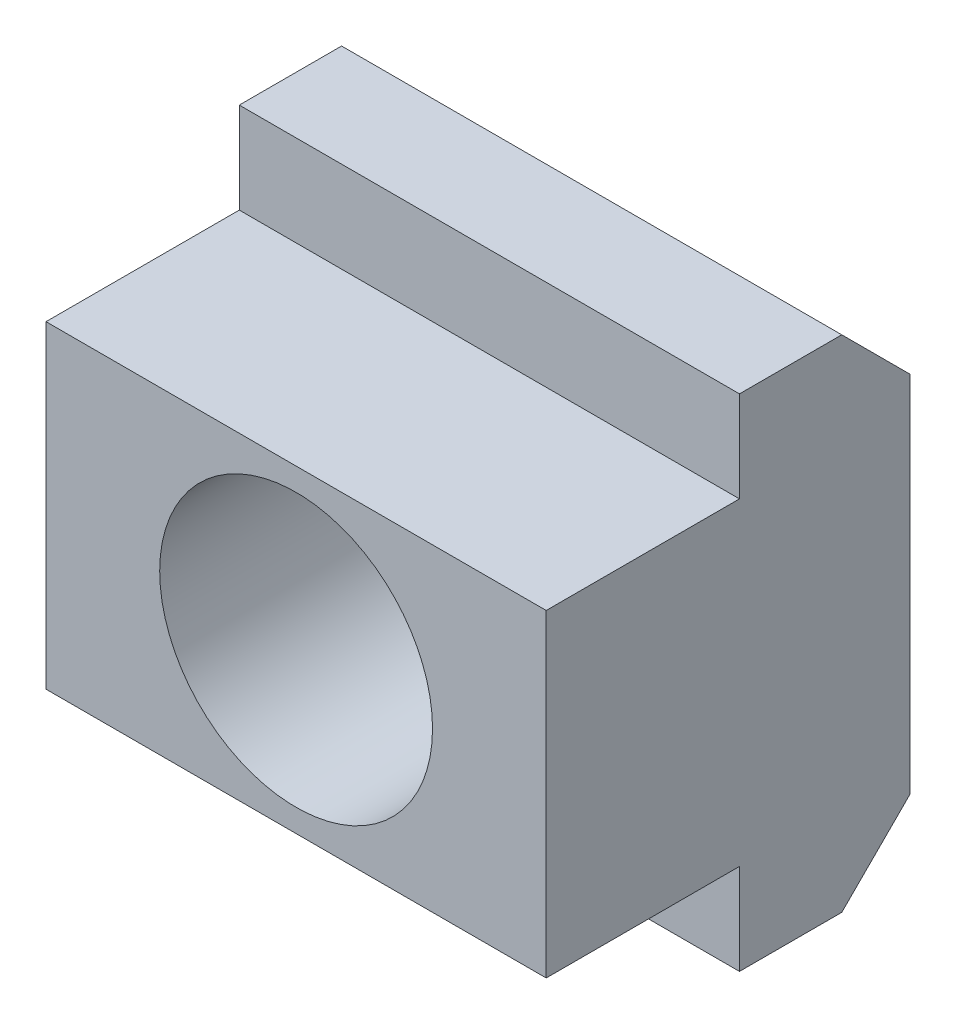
ISO-10303-21;
HEADER;
FILE_DESCRIPTION(('STEP AP214'),'2;1');
FILE_NAME('part.step','',(''),(''),'','','');
FILE_SCHEMA(('AUTOMOTIVE_DESIGN { 1 0 10303 214 1 1 1 1 }'));
ENDSEC;
DATA;
#1=APPLICATION_CONTEXT('core data for automotive mechanical design processes');
#2=APPLICATION_PROTOCOL_DEFINITION('international standard','automotive_design',2000,#1);
#3=PRODUCT_CONTEXT('',#1,'mechanical');
#4=PRODUCT('Part','Part','',(#3));
#5=PRODUCT_RELATED_PRODUCT_CATEGORY('part','',(#4));
#6=PRODUCT_DEFINITION_FORMATION('','',#4);
#7=PRODUCT_DEFINITION_CONTEXT('part definition',#1,'design');
#8=PRODUCT_DEFINITION('design','',#6,#7);
#9=PRODUCT_DEFINITION_SHAPE('','',#8);
#10=(LENGTH_UNIT() NAMED_UNIT(*) SI_UNIT(.MILLI.,.METRE.));
#11=(NAMED_UNIT(*) PLANE_ANGLE_UNIT() SI_UNIT($,.RADIAN.));
#12=(NAMED_UNIT(*) SI_UNIT($,.STERADIAN.) SOLID_ANGLE_UNIT());
#13=UNCERTAINTY_MEASURE_WITH_UNIT(LENGTH_MEASURE(1.E-05),#10,'distance_accuracy_value','');
#14=(GEOMETRIC_REPRESENTATION_CONTEXT(3) GLOBAL_UNCERTAINTY_ASSIGNED_CONTEXT((#13)) GLOBAL_UNIT_ASSIGNED_CONTEXT((#10,
#11,#12)) REPRESENTATION_CONTEXT('',''));
#15=CARTESIAN_POINT('',(0.,0.,0.));
#16=DIRECTION('',(0.,0.,1.));
#17=DIRECTION('',(1.,0.,0.));
#18=AXIS2_PLACEMENT_3D('',#15,#16,#17);
#19=CARTESIAN_POINT('',(-11.,-7.,8.5));
#20=DIRECTION('',(0.,1.,0.));
#21=DIRECTION('',(-1.,0.,0.));
#22=AXIS2_PLACEMENT_3D('',#19,#20,#21);
#23=PLANE('',#22);
#24=DIRECTION('',(0.,0.,1.));
#25=VECTOR('',#24,1.);
#26=CARTESIAN_POINT('',(11.,-7.,8.5));
#27=LINE('',#26,#25);
#28=CARTESIAN_POINT('',(11.,-7.,0.));
#29=VERTEX_POINT('',#28);
#30=CARTESIAN_POINT('',(11.,-7.,8.5));
#31=VERTEX_POINT('',#30);
#32=EDGE_CURVE('E99',#29,#31,#27,.T.);
#33=ORIENTED_EDGE('',*,*,#32,.T.);
#34=DIRECTION('',(1.,0.,0.));
#35=VECTOR('',#34,1.);
#36=CARTESIAN_POINT('',(-11.,-7.,8.5));
#37=LINE('',#36,#35);
#38=CARTESIAN_POINT('',(-11.,-7.,8.5));
#39=VERTEX_POINT('',#38);
#40=EDGE_CURVE('E107',#39,#31,#37,.T.);
#41=ORIENTED_EDGE('',*,*,#40,.F.);
#42=DIRECTION('',(0.,0.,1.));
#43=VECTOR('',#42,1.);
#44=CARTESIAN_POINT('',(-11.,-7.,8.5));
#45=LINE('',#44,#43);
#46=CARTESIAN_POINT('',(-11.,-7.,0.));
#47=VERTEX_POINT('',#46);
#48=EDGE_CURVE('E137',#47,#39,#45,.T.);
#49=ORIENTED_EDGE('',*,*,#48,.F.);
#50=DIRECTION('',(1.,0.,0.));
#51=VECTOR('',#50,1.);
#52=CARTESIAN_POINT('',(-11.,-7.,0.));
#53=LINE('',#52,#51);
#54=EDGE_CURVE('E118',#47,#29,#53,.T.);
#55=ORIENTED_EDGE('',*,*,#54,.T.);
#56=EDGE_LOOP('',(#33,#41,#49,#55));
#57=FACE_BOUND('',#56,.T.);
#58=ADVANCED_FACE('F15',(#57),#23,.F.);
#59=CARTESIAN_POINT('',(-11.,7.,8.5));
#60=DIRECTION('',(0.,0.,-1.));
#61=DIRECTION('',(1.,0.,0.));
#62=AXIS2_PLACEMENT_3D('',#59,#60,#61);
#63=PLANE('',#62);
#64=CARTESIAN_POINT('',(0.,0.,8.5));
#65=DIRECTION('',(0.,0.,1.));
#66=DIRECTION('',(-1.,0.,0.));
#67=AXIS2_PLACEMENT_3D('',#64,#65,#66);
#68=CIRCLE('',#67,6.);
#69=CARTESIAN_POINT('',(-6.,0.,8.5));
#70=VERTEX_POINT('',#69);
#71=EDGE_CURVE('E122',#70,#70,#68,.T.);
#72=ORIENTED_EDGE('',*,*,#71,.F.);
#73=EDGE_LOOP('',(#72));
#74=FACE_BOUND('',#73,.T.);
#75=DIRECTION('',(0.,1.,0.));
#76=VECTOR('',#75,1.);
#77=CARTESIAN_POINT('',(11.,7.,8.5));
#78=LINE('',#77,#76);
#79=CARTESIAN_POINT('',(11.,7.,8.5));
#80=VERTEX_POINT('',#79);
#81=EDGE_CURVE('E93',#31,#80,#78,.T.);
#82=ORIENTED_EDGE('',*,*,#81,.T.);
#83=DIRECTION('',(1.,0.,0.));
#84=VECTOR('',#83,1.);
#85=CARTESIAN_POINT('',(-11.,7.,8.5));
#86=LINE('',#85,#84);
#87=CARTESIAN_POINT('',(-11.,7.,8.5));
#88=VERTEX_POINT('',#87);
#89=EDGE_CURVE('E114',#88,#80,#86,.T.);
#90=ORIENTED_EDGE('',*,*,#89,.F.);
#91=DIRECTION('',(0.,1.,0.));
#92=VECTOR('',#91,1.);
#93=CARTESIAN_POINT('',(-11.,7.,8.5));
#94=LINE('',#93,#92);
#95=EDGE_CURVE('E109',#39,#88,#94,.T.);
#96=ORIENTED_EDGE('',*,*,#95,.F.);
#97=ORIENTED_EDGE('',*,*,#40,.T.);
#98=EDGE_LOOP('',(#82,#90,#96,#97));
#99=FACE_BOUND('',#98,.T.);
#100=ADVANCED_FACE('F108',(#74,#99),#63,.F.);
#101=CARTESIAN_POINT('',(-11.,7.,8.5));
#102=DIRECTION('',(0.,-1.,0.));
#103=DIRECTION('',(1.,0.,0.));
#104=AXIS2_PLACEMENT_3D('',#101,#102,#103);
#105=PLANE('',#104);
#106=DIRECTION('',(0.,0.,-1.));
#107=VECTOR('',#106,1.);
#108=CARTESIAN_POINT('',(11.,7.,8.5));
#109=LINE('',#108,#107);
#110=CARTESIAN_POINT('',(11.,7.,0.));
#111=VERTEX_POINT('',#110);
#112=EDGE_CURVE('E101',#80,#111,#109,.T.);
#113=ORIENTED_EDGE('',*,*,#112,.T.);
#114=DIRECTION('',(1.,0.,0.));
#115=VECTOR('',#114,1.);
#116=CARTESIAN_POINT('',(-11.,7.,0.));
#117=LINE('',#116,#115);
#118=CARTESIAN_POINT('',(-11.,7.,0.));
#119=VERTEX_POINT('',#118);
#120=EDGE_CURVE('E159',#119,#111,#117,.T.);
#121=ORIENTED_EDGE('',*,*,#120,.F.);
#122=DIRECTION('',(0.,0.,-1.));
#123=VECTOR('',#122,1.);
#124=CARTESIAN_POINT('',(-11.,7.,8.5));
#125=LINE('',#124,#123);
#126=EDGE_CURVE('E140',#88,#119,#125,.T.);
#127=ORIENTED_EDGE('',*,*,#126,.F.);
#128=ORIENTED_EDGE('',*,*,#89,.T.);
#129=EDGE_LOOP('',(#113,#121,#127,#128));
#130=FACE_BOUND('',#129,.T.);
#131=ADVANCED_FACE('F200',(#130),#105,.F.);
#132=CARTESIAN_POINT('',(-11.,7.,0.));
#133=DIRECTION('',(0.,0.,-1.));
#134=DIRECTION('',(0.,-1.,0.));
#135=AXIS2_PLACEMENT_3D('',#132,#133,#134);
#136=PLANE('',#135);
#137=DIRECTION('',(0.,1.,0.));
#138=VECTOR('',#137,1.);
#139=CARTESIAN_POINT('',(11.,7.,0.));
#140=LINE('',#139,#138);
#141=CARTESIAN_POINT('',(11.,11.,0.));
#142=VERTEX_POINT('',#141);
#143=EDGE_CURVE('E127',#111,#142,#140,.T.);
#144=ORIENTED_EDGE('',*,*,#143,.T.);
#145=DIRECTION('',(1.,0.,0.));
#146=VECTOR('',#145,1.);
#147=CARTESIAN_POINT('',(-11.,11.,0.));
#148=LINE('',#147,#146);
#149=CARTESIAN_POINT('',(-11.,11.,0.));
#150=VERTEX_POINT('',#149);
#151=EDGE_CURVE('E156',#150,#142,#148,.T.);
#152=ORIENTED_EDGE('',*,*,#151,.F.);
#153=DIRECTION('',(0.,1.,0.));
#154=VECTOR('',#153,1.);
#155=CARTESIAN_POINT('',(-11.,7.,0.));
#156=LINE('',#155,#154);
#157=EDGE_CURVE('E142',#119,#150,#156,.T.);
#158=ORIENTED_EDGE('',*,*,#157,.F.);
#159=ORIENTED_EDGE('',*,*,#120,.T.);
#160=EDGE_LOOP('',(#144,#152,#158,#159));
#161=FACE_BOUND('',#160,.T.);
#162=ADVANCED_FACE('F196',(#161),#136,.F.);
#163=CARTESIAN_POINT('',(-11.,11.,0.));
#164=DIRECTION('',(0.,-1.,0.));
#165=DIRECTION('',(1.,0.,0.));
#166=AXIS2_PLACEMENT_3D('',#163,#164,#165);
#167=PLANE('',#166);
#168=DIRECTION('',(0.,0.,-1.));
#169=VECTOR('',#168,1.);
#170=CARTESIAN_POINT('',(11.,11.,0.));
#171=LINE('',#170,#169);
#172=CARTESIAN_POINT('',(11.,11.,-4.5));
#173=VERTEX_POINT('',#172);
#174=EDGE_CURVE('E129',#142,#173,#171,.T.);
#175=ORIENTED_EDGE('',*,*,#174,.T.);
#176=DIRECTION('',(-1.,0.,0.));
#177=VECTOR('',#176,1.);
#178=CARTESIAN_POINT('',(-11.,11.,-4.5));
#179=LINE('',#178,#177);
#180=CARTESIAN_POINT('',(-11.,11.,-4.5));
#181=VERTEX_POINT('',#180);
#182=EDGE_CURVE('E9',#173,#181,#179,.T.);
#183=ORIENTED_EDGE('',*,*,#182,.T.);
#184=DIRECTION('',(0.,0.,-1.));
#185=VECTOR('',#184,1.);
#186=CARTESIAN_POINT('',(-11.,11.,0.));
#187=LINE('',#186,#185);
#188=EDGE_CURVE('E144',#150,#181,#187,.T.);
#189=ORIENTED_EDGE('',*,*,#188,.F.);
#190=ORIENTED_EDGE('',*,*,#151,.T.);
#191=EDGE_LOOP('',(#175,#183,#189,#190));
#192=FACE_BOUND('',#191,.T.);
#193=ADVANCED_FACE('F192',(#192),#167,.F.);
#194=CARTESIAN_POINT('',(-11.,11.,-7.5));
#195=DIRECTION('',(0.,0.,1.));
#196=DIRECTION('',(-1.,0.,0.));
#197=AXIS2_PLACEMENT_3D('',#194,#195,#196);
#198=PLANE('',#197);
#199=CARTESIAN_POINT('',(0.,0.,-7.5));
#200=DIRECTION('',(0.,0.,1.));
#201=DIRECTION('',(-1.,0.,0.));
#202=AXIS2_PLACEMENT_3D('',#199,#200,#201);
#203=CIRCLE('',#202,6.);
#204=CARTESIAN_POINT('',(-6.,0.,-7.5));
#205=VERTEX_POINT('',#204);
#206=EDGE_CURVE('E119',#205,#205,#203,.T.);
#207=ORIENTED_EDGE('',*,*,#206,.T.);
#208=EDGE_LOOP('',(#207));
#209=FACE_BOUND('',#208,.T.);
#210=DIRECTION('',(0.,-1.,0.));
#211=VECTOR('',#210,1.);
#212=CARTESIAN_POINT('',(11.,11.,-7.5));
#213=LINE('',#212,#211);
#214=CARTESIAN_POINT('',(11.,8.,-7.5));
#215=VERTEX_POINT('',#214);
#216=CARTESIAN_POINT('',(11.,-8.,-7.5));
#217=VERTEX_POINT('',#216);
#218=EDGE_CURVE('E131',#215,#217,#213,.T.);
#219=ORIENTED_EDGE('',*,*,#218,.T.);
#220=DIRECTION('',(-1.,0.,0.));
#221=VECTOR('',#220,1.);
#222=CARTESIAN_POINT('',(-11.,-8.,-7.5));
#223=LINE('',#222,#221);
#224=CARTESIAN_POINT('',(-11.,-8.,-7.5));
#225=VERTEX_POINT('',#224);
#226=EDGE_CURVE('E35',#217,#225,#223,.T.);
#227=ORIENTED_EDGE('',*,*,#226,.T.);
#228=DIRECTION('',(0.,-1.,0.));
#229=VECTOR('',#228,1.);
#230=CARTESIAN_POINT('',(-11.,11.,-7.5));
#231=LINE('',#230,#229);
#232=CARTESIAN_POINT('',(-11.,8.,-7.5));
#233=VERTEX_POINT('',#232);
#234=EDGE_CURVE('E146',#233,#225,#231,.T.);
#235=ORIENTED_EDGE('',*,*,#234,.F.);
#236=DIRECTION('',(1.,0.,0.));
#237=VECTOR('',#236,1.);
#238=CARTESIAN_POINT('',(-11.,8.,-7.5));
#239=LINE('',#238,#237);
#240=EDGE_CURVE('E169',#233,#215,#239,.T.);
#241=ORIENTED_EDGE('',*,*,#240,.T.);
#242=EDGE_LOOP('',(#219,#227,#235,#241));
#243=FACE_BOUND('',#242,.T.);
#244=ADVANCED_FACE('F186',(#209,#243),#198,.F.);
#245=CARTESIAN_POINT('',(-11.,-11.,0.));
#246=DIRECTION('',(0.,1.,0.));
#247=DIRECTION('',(-1.,0.,0.));
#248=AXIS2_PLACEMENT_3D('',#245,#246,#247);
#249=PLANE('',#248);
#250=DIRECTION('',(0.,0.,1.));
#251=VECTOR('',#250,1.);
#252=CARTESIAN_POINT('',(-11.,-11.,0.));
#253=LINE('',#252,#251);
#254=CARTESIAN_POINT('',(-11.,-11.,-4.5));
#255=VERTEX_POINT('',#254);
#256=CARTESIAN_POINT('',(-11.,-11.,0.));
#257=VERTEX_POINT('',#256);
#258=EDGE_CURVE('E148',#255,#257,#253,.T.);
#259=ORIENTED_EDGE('',*,*,#258,.F.);
#260=DIRECTION('',(1.,0.,0.));
#261=VECTOR('',#260,1.);
#262=CARTESIAN_POINT('',(-11.,-11.,-4.5));
#263=LINE('',#262,#261);
#264=CARTESIAN_POINT('',(11.,-11.,-4.5));
#265=VERTEX_POINT('',#264);
#266=EDGE_CURVE('E113',#255,#265,#263,.T.);
#267=ORIENTED_EDGE('',*,*,#266,.T.);
#268=DIRECTION('',(0.,0.,1.));
#269=VECTOR('',#268,1.);
#270=CARTESIAN_POINT('',(11.,-11.,0.));
#271=LINE('',#270,#269);
#272=CARTESIAN_POINT('',(11.,-11.,0.));
#273=VERTEX_POINT('',#272);
#274=EDGE_CURVE('E133',#265,#273,#271,.T.);
#275=ORIENTED_EDGE('',*,*,#274,.T.);
#276=DIRECTION('',(1.,0.,0.));
#277=VECTOR('',#276,1.);
#278=CARTESIAN_POINT('',(-11.,-11.,0.));
#279=LINE('',#278,#277);
#280=EDGE_CURVE('E153',#257,#273,#279,.T.);
#281=ORIENTED_EDGE('',*,*,#280,.F.);
#282=EDGE_LOOP('',(#259,#267,#275,#281));
#283=FACE_BOUND('',#282,.T.);
#284=ADVANCED_FACE('F182',(#283),#249,.F.);
#285=CARTESIAN_POINT('',(-11.,-7.,0.));
#286=DIRECTION('',(0.,0.,-1.));
#287=DIRECTION('',(0.,-1.,0.));
#288=AXIS2_PLACEMENT_3D('',#285,#286,#287);
#289=PLANE('',#288);
#290=DIRECTION('',(0.,1.,0.));
#291=VECTOR('',#290,1.);
#292=CARTESIAN_POINT('',(11.,-7.,0.));
#293=LINE('',#292,#291);
#294=EDGE_CURVE('E135',#273,#29,#293,.T.);
#295=ORIENTED_EDGE('',*,*,#294,.T.);
#296=ORIENTED_EDGE('',*,*,#54,.F.);
#297=DIRECTION('',(0.,1.,0.));
#298=VECTOR('',#297,1.);
#299=CARTESIAN_POINT('',(-11.,-7.,0.));
#300=LINE('',#299,#298);
#301=EDGE_CURVE('E150',#257,#47,#300,.T.);
#302=ORIENTED_EDGE('',*,*,#301,.F.);
#303=ORIENTED_EDGE('',*,*,#280,.T.);
#304=EDGE_LOOP('',(#295,#296,#302,#303));
#305=FACE_BOUND('',#304,.T.);
#306=ADVANCED_FACE('F202',(#305),#289,.F.);
#307=CARTESIAN_POINT('',(-11.,-7.,-7.5));
#308=DIRECTION('',(-1.,0.,0.));
#309=DIRECTION('',(0.,-1.,0.));
#310=AXIS2_PLACEMENT_3D('',#307,#308,#309);
#311=PLANE('',#310);
#312=ORIENTED_EDGE('',*,*,#234,.T.);
#313=DIRECTION('',(0.,0.707106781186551,-0.707106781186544));
#314=VECTOR('',#313,1.);
#315=CARTESIAN_POINT('',(-11.,-7.5,-8.));
#316=LINE('',#315,#314);
#317=EDGE_CURVE('E22',#225,#255,#316,.F.);
#318=ORIENTED_EDGE('',*,*,#317,.T.);
#319=ORIENTED_EDGE('',*,*,#258,.T.);
#320=ORIENTED_EDGE('',*,*,#301,.T.);
#321=ORIENTED_EDGE('',*,*,#48,.T.);
#322=ORIENTED_EDGE('',*,*,#95,.T.);
#323=ORIENTED_EDGE('',*,*,#126,.T.);
#324=ORIENTED_EDGE('',*,*,#157,.T.);
#325=ORIENTED_EDGE('',*,*,#188,.T.);
#326=DIRECTION('',(0.,0.707106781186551,0.707106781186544));
#327=VECTOR('',#326,1.);
#328=CARTESIAN_POINT('',(-11.,0.499999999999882,-15.));
#329=LINE('',#328,#327);
#330=EDGE_CURVE('E173',#181,#233,#329,.F.);
#331=ORIENTED_EDGE('',*,*,#330,.T.);
#332=EDGE_LOOP('',(#312,#318,#319,#320,#321,#322,#323,#324,#325,#331));
#333=FACE_BOUND('',#332,.T.);
#334=ADVANCED_FACE('F177',(#333),#311,.T.);
#335=CARTESIAN_POINT('',(11.,-7.,-7.5));
#336=DIRECTION('',(-1.,0.,0.));
#337=DIRECTION('',(0.,-1.,0.));
#338=AXIS2_PLACEMENT_3D('',#335,#336,#337);
#339=PLANE('',#338);
#340=ORIENTED_EDGE('',*,*,#274,.F.);
#341=DIRECTION('',(0.,-0.707106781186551,0.707106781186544));
#342=VECTOR('',#341,1.);
#343=CARTESIAN_POINT('',(11.,-11.,-4.5));
#344=LINE('',#343,#342);
#345=EDGE_CURVE('E167',#265,#217,#344,.F.);
#346=ORIENTED_EDGE('',*,*,#345,.T.);
#347=ORIENTED_EDGE('',*,*,#218,.F.);
#348=DIRECTION('',(0.,-0.707106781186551,-0.707106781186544));
#349=VECTOR('',#348,1.);
#350=CARTESIAN_POINT('',(11.,8.,-7.5));
#351=LINE('',#350,#349);
#352=EDGE_CURVE('E165',#215,#173,#351,.F.);
#353=ORIENTED_EDGE('',*,*,#352,.T.);
#354=ORIENTED_EDGE('',*,*,#174,.F.);
#355=ORIENTED_EDGE('',*,*,#143,.F.);
#356=ORIENTED_EDGE('',*,*,#112,.F.);
#357=ORIENTED_EDGE('',*,*,#81,.F.);
#358=ORIENTED_EDGE('',*,*,#32,.F.);
#359=ORIENTED_EDGE('',*,*,#294,.F.);
#360=EDGE_LOOP('',(#340,#346,#347,#353,#354,#355,#356,#357,#358,#359));
#361=FACE_BOUND('',#360,.T.);
#362=ADVANCED_FACE('F96',(#361),#339,.F.);
#363=CARTESIAN_POINT('',(-11.,-11.,-4.5));
#364=DIRECTION('',(0.,0.707106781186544,0.707106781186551));
#365=DIRECTION('',(0.,0.707106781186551,-0.707106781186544));
#366=AXIS2_PLACEMENT_3D('',#363,#364,#365);
#367=PLANE('',#366);
#368=ORIENTED_EDGE('',*,*,#317,.F.);
#369=ORIENTED_EDGE('',*,*,#226,.F.);
#370=ORIENTED_EDGE('',*,*,#345,.F.);
#371=ORIENTED_EDGE('',*,*,#266,.F.);
#372=EDGE_LOOP('',(#368,#369,#370,#371));
#373=FACE_BOUND('',#372,.T.);
#374=ADVANCED_FACE('F184',(#373),#367,.F.);
#375=CARTESIAN_POINT('',(-11.,8.,-7.5));
#376=DIRECTION('',(0.,-0.707106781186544,0.707106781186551));
#377=DIRECTION('',(0.,0.707106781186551,0.707106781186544));
#378=AXIS2_PLACEMENT_3D('',#375,#376,#377);
#379=PLANE('',#378);
#380=ORIENTED_EDGE('',*,*,#330,.F.);
#381=ORIENTED_EDGE('',*,*,#182,.F.);
#382=ORIENTED_EDGE('',*,*,#352,.F.);
#383=ORIENTED_EDGE('',*,*,#240,.F.);
#384=EDGE_LOOP('',(#380,#381,#382,#383));
#385=FACE_BOUND('',#384,.T.);
#386=ADVANCED_FACE('F190',(#385),#379,.F.);
#387=CARTESIAN_POINT('',(0.,0.,-7.5));
#388=DIRECTION('',(0.,0.,1.));
#389=DIRECTION('',(-1.,0.,0.));
#390=AXIS2_PLACEMENT_3D('',#387,#388,#389);
#391=CYLINDRICAL_SURFACE('',#390,6.);
#392=ORIENTED_EDGE('',*,*,#206,.F.);
#393=EDGE_LOOP('',(#392));
#394=FACE_BOUND('',#393,.T.);
#395=ORIENTED_EDGE('',*,*,#71,.T.);
#396=EDGE_LOOP('',(#395));
#397=FACE_BOUND('',#396,.T.);
#398=ADVANCED_FACE('F237',(#394,#397),#391,.F.);
#399=CLOSED_SHELL('',(#58,#100,#131,#162,#193,#244,#284,#306,#334,#362,#374,#386,#398));
#400=MANIFOLD_SOLID_BREP('B1',#399);
#401=ADVANCED_BREP_SHAPE_REPRESENTATION('',(#18,#400),#14);
#402=SHAPE_DEFINITION_REPRESENTATION(#9,#401);
ENDSEC;
END-ISO-10303-21;
